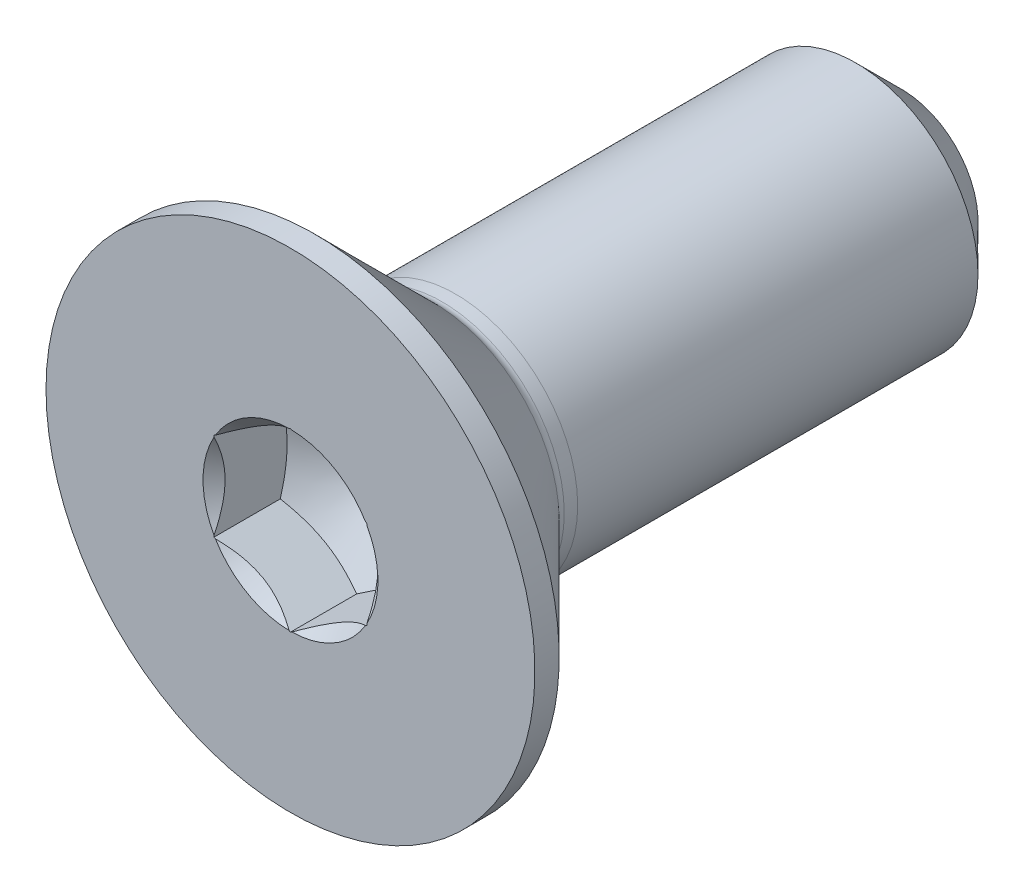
ISO-10303-21;
HEADER;
FILE_DESCRIPTION(('STEP AP214'),'2;1');
FILE_NAME('part.step','',(''),(''),'','','');
FILE_SCHEMA(('AUTOMOTIVE_DESIGN { 1 0 10303 214 1 1 1 1 }'));
ENDSEC;
DATA;
#1=APPLICATION_CONTEXT('core data for automotive mechanical design processes');
#2=APPLICATION_PROTOCOL_DEFINITION('international standard','automotive_design',2000,#1);
#3=PRODUCT_CONTEXT('',#1,'mechanical');
#4=PRODUCT('Part','Part','',(#3));
#5=PRODUCT_RELATED_PRODUCT_CATEGORY('part','',(#4));
#6=PRODUCT_DEFINITION_FORMATION('','',#4);
#7=PRODUCT_DEFINITION_CONTEXT('part definition',#1,'design');
#8=PRODUCT_DEFINITION('design','',#6,#7);
#9=PRODUCT_DEFINITION_SHAPE('','',#8);
#10=(LENGTH_UNIT() NAMED_UNIT(*) SI_UNIT(.MILLI.,.METRE.));
#11=(NAMED_UNIT(*) PLANE_ANGLE_UNIT() SI_UNIT($,.RADIAN.));
#12=(NAMED_UNIT(*) SI_UNIT($,.STERADIAN.) SOLID_ANGLE_UNIT());
#13=UNCERTAINTY_MEASURE_WITH_UNIT(LENGTH_MEASURE(1.E-05),#10,'distance_accuracy_value','');
#14=(GEOMETRIC_REPRESENTATION_CONTEXT(3) GLOBAL_UNCERTAINTY_ASSIGNED_CONTEXT((#13)) GLOBAL_UNIT_ASSIGNED_CONTEXT((#10,
#11,#12)) REPRESENTATION_CONTEXT('',''));
#15=CARTESIAN_POINT('',(0.,0.,0.));
#16=DIRECTION('',(0.,0.,1.));
#17=DIRECTION('',(1.,0.,0.));
#18=AXIS2_PLACEMENT_3D('',#15,#16,#17);
#19=CARTESIAN_POINT('',(0.,0.,0.));
#20=DIRECTION('',(0.,0.,-1.));
#21=DIRECTION('',(-1.,0.,0.));
#22=AXIS2_PLACEMENT_3D('',#19,#20,#21);
#23=CYLINDRICAL_SURFACE('',#22,4.);
#24=CARTESIAN_POINT('',(0.,0.,-18.5));
#25=DIRECTION('',(0.,0.,-1.));
#26=DIRECTION('',(-1.,0.,0.));
#27=AXIS2_PLACEMENT_3D('',#24,#25,#26);
#28=CIRCLE('',#27,4.);
#29=CARTESIAN_POINT('',(-4.,0.,-18.5));
#30=VERTEX_POINT('',#29);
#31=EDGE_CURVE('E52',#30,#30,#28,.T.);
#32=ORIENTED_EDGE('',*,*,#31,.F.);
#33=EDGE_LOOP('',(#32));
#34=FACE_BOUND('',#33,.T.);
#35=CARTESIAN_POINT('',(0.,0.,-5.4));
#36=DIRECTION('',(0.,0.,-1.));
#37=DIRECTION('',(-1.,0.,0.));
#38=AXIS2_PLACEMENT_3D('',#35,#36,#37);
#39=CIRCLE('',#38,4.);
#40=CARTESIAN_POINT('',(-4.,0.,-5.4));
#41=VERTEX_POINT('',#40);
#42=EDGE_CURVE('E11',#41,#41,#39,.T.);
#43=ORIENTED_EDGE('',*,*,#42,.T.);
#44=EDGE_LOOP('',(#43));
#45=FACE_BOUND('',#44,.T.);
#46=ADVANCED_FACE('F46',(#34,#45),#23,.T.);
#47=CARTESIAN_POINT('',(0.,0.,-5.4));
#48=DIRECTION('',(0.,0.,1.));
#49=DIRECTION('',(1.,0.,0.));
#50=AXIS2_PLACEMENT_3D('',#47,#48,#49);
#51=PLANE('',#50);
#52=ORIENTED_EDGE('',*,*,#42,.F.);
#53=EDGE_LOOP('',(#52));
#54=FACE_BOUND('',#53,.T.);
#55=ADVANCED_FACE('F67',(#54),#51,.T.);
#56=CARTESIAN_POINT('',(0.,0.,-18.5));
#57=DIRECTION('',(0.,0.,1.));
#58=DIRECTION('',(1.,0.,0.));
#59=AXIS2_PLACEMENT_3D('',#56,#57,#58);
#60=CONICAL_SURFACE('',#59,4.,0.785398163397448);
#61=CARTESIAN_POINT('',(0.,0.,-20.));
#62=DIRECTION('',(0.,0.,-1.));
#63=DIRECTION('',(-1.,0.,0.));
#64=AXIS2_PLACEMENT_3D('',#61,#62,#63);
#65=CIRCLE('',#64,2.5);
#66=CARTESIAN_POINT('',(-2.5,0.,-20.));
#67=VERTEX_POINT('',#66);
#68=EDGE_CURVE('E56',#67,#67,#65,.T.);
#69=ORIENTED_EDGE('',*,*,#68,.F.);
#70=EDGE_LOOP('',(#69));
#71=FACE_BOUND('',#70,.T.);
#72=ORIENTED_EDGE('',*,*,#31,.T.);
#73=EDGE_LOOP('',(#72));
#74=FACE_BOUND('',#73,.T.);
#75=ADVANCED_FACE('F65',(#71,#74),#60,.T.);
#76=CARTESIAN_POINT('',(0.,0.,-20.));
#77=DIRECTION('',(0.,0.,1.));
#78=DIRECTION('',(1.,0.,0.));
#79=AXIS2_PLACEMENT_3D('',#76,#77,#78);
#80=PLANE('',#79);
#81=ORIENTED_EDGE('',*,*,#68,.T.);
#82=EDGE_LOOP('',(#81));
#83=FACE_BOUND('',#82,.T.);
#84=ADVANCED_FACE('F63',(#83),#80,.F.);
#85=CLOSED_SHELL('',(#46,#55,#75,#84));
#86=MANIFOLD_SOLID_BREP('B2',#85);
#87=CARTESIAN_POINT('',(0.,0.,-4.96));
#88=DIRECTION('',(0.,0.,-1.));
#89=DIRECTION('',(-1.,0.,0.));
#90=AXIS2_PLACEMENT_3D('',#87,#88,#89);
#91=TOROIDAL_SURFACE('',#90,4.4,0.4);
#92=CARTESIAN_POINT('',(0.,0.,-4.96));
#93=DIRECTION('',(0.,0.,-1.));
#94=DIRECTION('',(-1.,0.,0.));
#95=AXIS2_PLACEMENT_3D('',#92,#93,#94);
#96=CIRCLE('',#95,4.);
#97=CARTESIAN_POINT('',(-4.,0.,-4.96));
#98=VERTEX_POINT('',#97);
#99=EDGE_CURVE('E231',#98,#98,#96,.T.);
#100=ORIENTED_EDGE('',*,*,#99,.F.);
#101=EDGE_LOOP('',(#100));
#102=FACE_BOUND('',#101,.T.);
#103=CARTESIAN_POINT('',(0.,0.,-4.67715728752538));
#104=DIRECTION('',(0.,0.,-1.));
#105=DIRECTION('',(-1.,0.,0.));
#106=AXIS2_PLACEMENT_3D('',#103,#104,#105);
#107=CIRCLE('',#106,4.11715728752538);
#108=CARTESIAN_POINT('',(-4.11715728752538,0.,-4.67715728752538));
#109=VERTEX_POINT('',#108);
#110=EDGE_CURVE('E252',#109,#109,#107,.T.);
#111=ORIENTED_EDGE('',*,*,#110,.T.);
#112=EDGE_LOOP('',(#111));
#113=FACE_BOUND('',#112,.T.);
#114=ADVANCED_FACE('F103',(#102,#113),#91,.F.);
#115=CARTESIAN_POINT('',(0.,0.,-0.794314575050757));
#116=DIRECTION('',(0.,0.,1.));
#117=DIRECTION('',(1.,0.,0.));
#118=AXIS2_PLACEMENT_3D('',#115,#116,#117);
#119=CONICAL_SURFACE('',#118,8.,0.785398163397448);
#120=ORIENTED_EDGE('',*,*,#110,.F.);
#121=EDGE_LOOP('',(#120));
#122=FACE_BOUND('',#121,.T.);
#123=CARTESIAN_POINT('',(0.,0.,-0.794314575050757));
#124=DIRECTION('',(0.,0.,-1.));
#125=DIRECTION('',(-1.,0.,0.));
#126=AXIS2_PLACEMENT_3D('',#123,#124,#125);
#127=CIRCLE('',#126,8.);
#128=CARTESIAN_POINT('',(-8.,0.,-0.794314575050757));
#129=VERTEX_POINT('',#128);
#130=EDGE_CURVE('E249',#129,#129,#127,.T.);
#131=ORIENTED_EDGE('',*,*,#130,.T.);
#132=EDGE_LOOP('',(#131));
#133=FACE_BOUND('',#132,.T.);
#134=ADVANCED_FACE('F416',(#122,#133),#119,.T.);
#135=CARTESIAN_POINT('',(0.,0.,0.));
#136=DIRECTION('',(0.,0.,-1.));
#137=DIRECTION('',(-1.,0.,0.));
#138=AXIS2_PLACEMENT_3D('',#135,#136,#137);
#139=CYLINDRICAL_SURFACE('',#138,8.);
#140=ORIENTED_EDGE('',*,*,#130,.F.);
#141=EDGE_LOOP('',(#140));
#142=FACE_BOUND('',#141,.T.);
#143=CARTESIAN_POINT('',(0.,0.,0.));
#144=DIRECTION('',(0.,0.,-1.));
#145=DIRECTION('',(-1.,0.,0.));
#146=AXIS2_PLACEMENT_3D('',#143,#144,#145);
#147=CIRCLE('',#146,8.);
#148=CARTESIAN_POINT('',(-8.,0.,0.));
#149=VERTEX_POINT('',#148);
#150=EDGE_CURVE('E246',#149,#149,#147,.T.);
#151=ORIENTED_EDGE('',*,*,#150,.T.);
#152=EDGE_LOOP('',(#151));
#153=FACE_BOUND('',#152,.T.);
#154=ADVANCED_FACE('F421',(#142,#153),#139,.T.);
#155=CARTESIAN_POINT('',(0.,0.,0.));
#156=DIRECTION('',(0.,0.,-1.));
#157=DIRECTION('',(-1.,0.,0.));
#158=AXIS2_PLACEMENT_3D('',#155,#156,#157);
#159=PLANE('',#158);
#160=ORIENTED_EDGE('',*,*,#150,.F.);
#161=EDGE_LOOP('',(#160));
#162=FACE_BOUND('',#161,.T.);
#163=DIRECTION('',(-0.866025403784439,-0.5,0.));
#164=VECTOR('',#163,1.);
#165=CARTESIAN_POINT('',(0.,2.88675134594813,0.));
#166=LINE('',#165,#164);
#167=CARTESIAN_POINT('',(-2.45566856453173,1.46897043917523,0.));
#168=VERTEX_POINT('',#167);
#169=CARTESIAN_POINT('',(-2.5,1.44337567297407,0.));
#170=VERTEX_POINT('',#169);
#171=EDGE_CURVE('E386',#168,#170,#166,.T.);
#172=ORIENTED_EDGE('',*,*,#171,.F.);
#173=CARTESIAN_POINT('',(0.,0.,0.));
#174=DIRECTION('',(0.,0.,-1.));
#175=DIRECTION('',(-1.,0.,0.));
#176=AXIS2_PLACEMENT_3D('',#173,#174,#175);
#177=CIRCLE('',#176,2.8615);
#178=CARTESIAN_POINT('',(-0.0443314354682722,2.86115657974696,0.));
#179=VERTEX_POINT('',#178);
#180=EDGE_CURVE('E213',#168,#179,#177,.T.);
#181=ORIENTED_EDGE('',*,*,#180,.T.);
#182=CARTESIAN_POINT('',(0.,2.88675134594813,0.));
#183=VERTEX_POINT('',#182);
#184=EDGE_CURVE('E224',#183,#179,#166,.T.);
#185=ORIENTED_EDGE('',*,*,#184,.F.);
#186=DIRECTION('',(-0.866025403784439,0.5,0.));
#187=VECTOR('',#186,1.);
#188=CARTESIAN_POINT('',(2.5,1.44337567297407,0.));
#189=LINE('',#188,#187);
#190=CARTESIAN_POINT('',(0.044331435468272,2.86115657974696,0.));
#191=VERTEX_POINT('',#190);
#192=EDGE_CURVE('E389',#191,#183,#189,.T.);
#193=ORIENTED_EDGE('',*,*,#192,.F.);
#194=CARTESIAN_POINT('',(2.45566856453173,1.46897043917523,0.));
#195=VERTEX_POINT('',#194);
#196=EDGE_CURVE('E400',#191,#195,#177,.T.);
#197=ORIENTED_EDGE('',*,*,#196,.T.);
#198=CARTESIAN_POINT('',(2.5,1.44337567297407,0.));
#199=VERTEX_POINT('',#198);
#200=EDGE_CURVE('E388',#199,#195,#189,.T.);
#201=ORIENTED_EDGE('',*,*,#200,.F.);
#202=DIRECTION('',(0.,1.,0.));
#203=VECTOR('',#202,1.);
#204=CARTESIAN_POINT('',(2.5,-1.44337567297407,0.));
#205=LINE('',#204,#203);
#206=CARTESIAN_POINT('',(2.5,1.39218614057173,0.));
#207=VERTEX_POINT('',#206);
#208=EDGE_CURVE('E392',#207,#199,#205,.T.);
#209=ORIENTED_EDGE('',*,*,#208,.F.);
#210=CARTESIAN_POINT('',(2.5,-1.39218614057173,0.));
#211=VERTEX_POINT('',#210);
#212=EDGE_CURVE('E398',#207,#211,#177,.T.);
#213=ORIENTED_EDGE('',*,*,#212,.T.);
#214=CARTESIAN_POINT('',(2.5,-1.44337567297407,0.));
#215=VERTEX_POINT('',#214);
#216=EDGE_CURVE('E377',#215,#211,#205,.T.);
#217=ORIENTED_EDGE('',*,*,#216,.F.);
#218=DIRECTION('',(0.866025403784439,0.5,0.));
#219=VECTOR('',#218,1.);
#220=CARTESIAN_POINT('',(0.,-2.88675134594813,0.));
#221=LINE('',#220,#219);
#222=CARTESIAN_POINT('',(2.45566856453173,-1.46897043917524,0.));
#223=VERTEX_POINT('',#222);
#224=EDGE_CURVE('E372',#223,#215,#221,.T.);
#225=ORIENTED_EDGE('',*,*,#224,.F.);
#226=CARTESIAN_POINT('',(0.0443314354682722,-2.86115657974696,0.));
#227=VERTEX_POINT('',#226);
#228=EDGE_CURVE('E396',#223,#227,#177,.T.);
#229=ORIENTED_EDGE('',*,*,#228,.T.);
#230=CARTESIAN_POINT('',(0.,-2.88675134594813,0.));
#231=VERTEX_POINT('',#230);
#232=EDGE_CURVE('E393',#231,#227,#221,.T.);
#233=ORIENTED_EDGE('',*,*,#232,.F.);
#234=DIRECTION('',(0.866025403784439,-0.5,0.));
#235=VECTOR('',#234,1.);
#236=CARTESIAN_POINT('',(-2.5,-1.44337567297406,0.));
#237=LINE('',#236,#235);
#238=CARTESIAN_POINT('',(-0.0443314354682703,-2.86115657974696,0.));
#239=VERTEX_POINT('',#238);
#240=EDGE_CURVE('E301',#239,#231,#237,.T.);
#241=ORIENTED_EDGE('',*,*,#240,.F.);
#242=CARTESIAN_POINT('',(-2.45566856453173,-1.46897043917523,0.));
#243=VERTEX_POINT('',#242);
#244=EDGE_CURVE('E122',#239,#243,#177,.T.);
#245=ORIENTED_EDGE('',*,*,#244,.T.);
#246=CARTESIAN_POINT('',(-2.5,-1.44337567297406,0.));
#247=VERTEX_POINT('',#246);
#248=EDGE_CURVE('E308',#247,#243,#237,.T.);
#249=ORIENTED_EDGE('',*,*,#248,.F.);
#250=DIRECTION('',(0.,-1.,0.));
#251=VECTOR('',#250,1.);
#252=CARTESIAN_POINT('',(-2.5,1.44337567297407,0.));
#253=LINE('',#252,#251);
#254=CARTESIAN_POINT('',(-2.5,-1.39218614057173,0.));
#255=VERTEX_POINT('',#254);
#256=EDGE_CURVE('E211',#255,#247,#253,.T.);
#257=ORIENTED_EDGE('',*,*,#256,.F.);
#258=CARTESIAN_POINT('',(-2.5,1.39218614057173,0.));
#259=VERTEX_POINT('',#258);
#260=EDGE_CURVE('E129',#255,#259,#177,.T.);
#261=ORIENTED_EDGE('',*,*,#260,.T.);
#262=EDGE_CURVE('E209',#170,#259,#253,.T.);
#263=ORIENTED_EDGE('',*,*,#262,.F.);
#264=EDGE_LOOP('',(#172,#181,#185,#193,#197,#201,#209,#213,#217,#225,#229,#233,#241,#245,#249,
#257,#261,#263));
#265=FACE_BOUND('',#264,.T.);
#266=ADVANCED_FACE('F208',(#162,#265),#159,.F.);
#267=CARTESIAN_POINT('',(0.,0.,-5.4));
#268=DIRECTION('',(0.,0.,1.));
#269=DIRECTION('',(1.,0.,0.));
#270=AXIS2_PLACEMENT_3D('',#267,#268,#269);
#271=PLANE('',#270);
#272=CARTESIAN_POINT('',(0.,0.,-5.4));
#273=DIRECTION('',(0.,0.,-1.));
#274=DIRECTION('',(-1.,0.,0.));
#275=AXIS2_PLACEMENT_3D('',#272,#273,#274);
#276=CIRCLE('',#275,4.);
#277=CARTESIAN_POINT('',(-4.,0.,-5.4));
#278=VERTEX_POINT('',#277);
#279=EDGE_CURVE('E243',#278,#278,#276,.T.);
#280=ORIENTED_EDGE('',*,*,#279,.T.);
#281=EDGE_LOOP('',(#280));
#282=FACE_BOUND('',#281,.T.);
#283=ADVANCED_FACE('F435',(#282),#271,.F.);
#284=CARTESIAN_POINT('',(0.,0.,0.));
#285=DIRECTION('',(0.,0.,-1.));
#286=DIRECTION('',(-1.,0.,0.));
#287=AXIS2_PLACEMENT_3D('',#284,#285,#286);
#288=CYLINDRICAL_SURFACE('',#287,4.);
#289=ORIENTED_EDGE('',*,*,#279,.F.);
#290=EDGE_LOOP('',(#289));
#291=FACE_BOUND('',#290,.T.);
#292=ORIENTED_EDGE('',*,*,#99,.T.);
#293=EDGE_LOOP('',(#292));
#294=FACE_BOUND('',#293,.T.);
#295=ADVANCED_FACE('F287',(#291,#294),#288,.T.);
#296=CARTESIAN_POINT('',(-2.5,-1.44337567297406,-3.83333333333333));
#297=DIRECTION('',(-0.5,-0.866025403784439,0.));
#298=DIRECTION('',(0.866025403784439,-0.5,0.));
#299=AXIS2_PLACEMENT_3D('',#296,#297,#298);
#300=PLANE('',#299);
#301=ORIENTED_EDGE('',*,*,#248,.T.);
#302=CARTESIAN_POINT('',(-2.45602453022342,-1.46876492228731,0.000200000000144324));
#303=CARTESIAN_POINT('',(-2.37266635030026,-1.5168917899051,-0.0466050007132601));
#304=CARTESIAN_POINT('',(-2.28794081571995,-1.56580810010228,-0.0905436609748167));
#305=CARTESIAN_POINT('',(-2.11532462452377,-1.66546810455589,-0.170781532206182));
#306=CARTESIAN_POINT('',(-2.02741967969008,-1.71622004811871,-0.207039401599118));
#307=CARTESIAN_POINT('',(-1.85019610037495,-1.81854012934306,-0.269015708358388));
#308=CARTESIAN_POINT('',(-1.76091695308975,-1.87008546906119,-0.294880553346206));
#309=CARTESIAN_POINT('',(-1.58051931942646,-1.97423809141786,-0.334592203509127));
#310=CARTESIAN_POINT('',(-1.48940545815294,-2.02684270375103,-0.34846610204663));
#311=CARTESIAN_POINT('',(-1.3302223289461,-2.11874712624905,-0.361004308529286));
#312=CARTESIAN_POINT('',(-1.26232496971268,-2.15794768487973,-0.362686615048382));
#313=CARTESIAN_POINT('',(-1.12666869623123,-2.2362688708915,-0.358670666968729));
#314=CARTESIAN_POINT('',(-1.05890983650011,-2.27538946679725,-0.352969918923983));
#315=CARTESIAN_POINT('',(-0.924061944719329,-2.35324393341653,-0.334513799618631));
#316=CARTESIAN_POINT('',(-0.856973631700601,-2.39197738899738,-0.321751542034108));
#317=CARTESIAN_POINT('',(-0.72396889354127,-2.46876771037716,-0.289866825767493));
#318=CARTESIAN_POINT('',(-0.65805236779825,-2.50682463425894,-0.270744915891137));
#319=CARTESIAN_POINT('',(-0.498170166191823,-2.59913266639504,-0.217124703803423));
#320=CARTESIAN_POINT('',(-0.404969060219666,-2.65294235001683,-0.179581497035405));
#321=CARTESIAN_POINT('',(-0.267695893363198,-2.73219704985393,-0.116647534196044));
#322=CARTESIAN_POINT('',(-0.222424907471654,-2.75833426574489,-0.0946039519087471));
#323=CARTESIAN_POINT('',(-0.132645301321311,-2.81016854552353,-0.0485843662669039));
#324=CARTESIAN_POINT('',(-0.0881363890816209,-2.83586577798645,-0.024609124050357));
#325=CARTESIAN_POINT('',(-0.0439754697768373,-2.86136209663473,0.000200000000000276));
#326=B_SPLINE_CURVE_WITH_KNOTS('',3,(#302,#303,#304,#305,#306,#307,#308,#309,#310,#311,#312,
#313,#314,#315,#316,#317,#318,#319,#320,#321,#322,#323,#324,#325),.UNSPECIFIED.,.F.,.F.,(4,2,2,
2,2,2,2,2,2,2,2,4),(0.,0.321296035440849,0.644279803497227,0.962539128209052,1.28007745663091,
1.51500097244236,1.75000384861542,1.98523630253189,2.22044846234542,2.56179557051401,
2.73196477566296,2.90206725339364),.UNSPECIFIED.);
#327=EDGE_CURVE('E202',#243,#239,#326,.T.);
#328=ORIENTED_EDGE('',*,*,#327,.T.);
#329=ORIENTED_EDGE('',*,*,#240,.T.);
#330=DIRECTION('',(0.,0.,1.));
#331=VECTOR('',#330,1.);
#332=CARTESIAN_POINT('',(0.,-2.88675134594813,-3.83333333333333));
#333=LINE('',#332,#331);
#334=CARTESIAN_POINT('',(0.,-2.88675134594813,-2.16666666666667));
#335=VERTEX_POINT('',#334);
#336=EDGE_CURVE('E219',#335,#231,#333,.T.);
#337=ORIENTED_EDGE('',*,*,#336,.F.);
#338=CARTESIAN_POINT('',(0.000200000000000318,-2.88686681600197,-2.16659999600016));
#339=CARTESIAN_POINT('',(-0.109663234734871,-2.82343724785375,-2.20323604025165));
#340=CARTESIAN_POINT('',(-0.220474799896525,-2.75946016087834,-2.23655544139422));
#341=CARTESIAN_POINT('',(-0.44401683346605,-2.63039810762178,-2.29471537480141));
#342=CARTESIAN_POINT('',(-0.556751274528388,-2.5653108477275,-2.31953533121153));
#343=CARTESIAN_POINT('',(-0.780822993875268,-2.43594298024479,-2.35817200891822));
#344=CARTESIAN_POINT('',(-0.892125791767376,-2.37168227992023,-2.37224586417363));
#345=CARTESIAN_POINT('',(-1.11525522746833,-2.24285844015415,-2.38904850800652));
#346=CARTESIAN_POINT('',(-1.22708105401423,-2.17829576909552,-2.39179120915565));
#347=CARTESIAN_POINT('',(-1.43604197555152,-2.05765212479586,-2.38609190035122));
#348=CARTESIAN_POINT('',(-1.53320831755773,-2.0015531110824,-2.37904926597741));
#349=CARTESIAN_POINT('',(-1.726907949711,-1.88972057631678,-2.35672624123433));
#350=CARTESIAN_POINT('',(-1.82344056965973,-1.8339874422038,-2.34143822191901));
#351=CARTESIAN_POINT('',(-2.01753972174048,-1.7219242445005,-2.30321856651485));
#352=CARTESIAN_POINT('',(-2.11508168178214,-1.66560836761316,-2.28012488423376));
#353=CARTESIAN_POINT('',(-2.30871060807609,-1.55381665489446,-2.22771100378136));
#354=CARTESIAN_POINT('',(-2.40480005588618,-1.49833938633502,-2.19840312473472));
#355=CARTESIAN_POINT('',(-2.5002,-1.44326020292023,-2.16659999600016));
#356=B_SPLINE_CURVE_WITH_KNOTS('',3,(#338,#339,#340,#341,#342,#343,#344,#345,#346,#347,#348,
#349,#350,#351,#352,#353,#354,#355),.UNSPECIFIED.,.F.,.F.,(4,2,2,2,2,2,2,2,4),(0.,
0.396285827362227,0.793524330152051,1.18093086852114,1.56786160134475,1.90479741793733,
2.24204551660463,2.58677531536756,2.93082800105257),.UNSPECIFIED.);
#357=CARTESIAN_POINT('',(-2.5,-1.44337567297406,-2.16666666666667));
#358=VERTEX_POINT('',#357);
#359=EDGE_CURVE('E116',#335,#358,#356,.T.);
#360=ORIENTED_EDGE('',*,*,#359,.T.);
#361=DIRECTION('',(0.,0.,1.));
#362=VECTOR('',#361,1.);
#363=CARTESIAN_POINT('',(-2.5,-1.44337567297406,-3.83333333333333));
#364=LINE('',#363,#362);
#365=EDGE_CURVE('E228',#358,#247,#364,.T.);
#366=ORIENTED_EDGE('',*,*,#365,.T.);
#367=EDGE_LOOP('',(#301,#328,#329,#337,#360,#366));
#368=FACE_BOUND('',#367,.T.);
#369=ADVANCED_FACE('F282',(#368),#300,.F.);
#370=CARTESIAN_POINT('',(-2.5,1.44337567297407,-3.83333333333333));
#371=DIRECTION('',(-1.,0.,0.));
#372=DIRECTION('',(0.,0.,1.));
#373=AXIS2_PLACEMENT_3D('',#370,#371,#372);
#374=PLANE('',#373);
#375=ORIENTED_EDGE('',*,*,#262,.T.);
#376=CARTESIAN_POINT('',(-2.5,-2.90777520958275,0.973230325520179));
#377=CARTESIAN_POINT('',(-2.5,-2.83710370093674,0.91965413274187));
#378=CARTESIAN_POINT('',(-2.5,-2.76603977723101,0.866587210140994));
#379=CARTESIAN_POINT('',(-2.5,-2.62297105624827,0.76170095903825));
#380=CARTESIAN_POINT('',(-2.5,-2.55096603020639,0.709881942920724));
#381=CARTESIAN_POINT('',(-2.5,-2.40533228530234,0.607351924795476));
#382=CARTESIAN_POINT('',(-2.5,-2.3316953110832,0.556652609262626));
#383=CARTESIAN_POINT('',(-2.5,-2.18317658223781,0.457117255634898));
#384=CARTESIAN_POINT('',(-2.5,-2.1082949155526,0.408281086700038));
#385=CARTESIAN_POINT('',(-2.5,-1.95265079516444,0.310090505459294));
#386=CARTESIAN_POINT('',(-2.5,-1.87180105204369,0.260873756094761));
#387=CARTESIAN_POINT('',(-2.5,-1.708234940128,0.165651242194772));
#388=CARTESIAN_POINT('',(-2.5,-1.62551881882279,0.119645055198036));
#389=CARTESIAN_POINT('',(-2.5,-1.45818603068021,0.0318111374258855));
#390=CARTESIAN_POINT('',(-2.5,-1.37357556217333,-0.0100283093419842));
#391=CARTESIAN_POINT('',(-2.5,-1.20202799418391,-0.0885842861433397));
#392=CARTESIAN_POINT('',(-2.5,-1.11509197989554,-0.125303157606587));
#393=CARTESIAN_POINT('',(-2.5,-0.946211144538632,-0.189469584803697));
#394=CARTESIAN_POINT('',(-2.5,-0.864466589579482,-0.217438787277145));
#395=CARTESIAN_POINT('',(-2.5,-0.698983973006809,-0.266823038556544));
#396=CARTESIAN_POINT('',(-2.5,-0.615245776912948,-0.28823764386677));
#397=CARTESIAN_POINT('',(-2.5,-0.44768276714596,-0.323029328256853));
#398=CARTESIAN_POINT('',(-2.5,-0.363887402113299,-0.336545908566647));
#399=CARTESIAN_POINT('',(-2.5,-0.19536880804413,-0.355274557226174));
#400=CARTESIAN_POINT('',(-2.5,-0.110645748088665,-0.360488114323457));
#401=CARTESIAN_POINT('',(-2.5,0.0556873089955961,-0.36221085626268));
#402=CARTESIAN_POINT('',(-2.5,0.137294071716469,-0.35904124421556));
#403=CARTESIAN_POINT('',(-2.5,0.299822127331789,-0.344888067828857));
#404=CARTESIAN_POINT('',(-2.5,0.380743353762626,-0.333903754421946));
#405=CARTESIAN_POINT('',(-2.5,0.542686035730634,-0.304539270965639));
#406=CARTESIAN_POINT('',(-2.5,0.623684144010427,-0.286032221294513));
#407=CARTESIAN_POINT('',(-2.5,0.783903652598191,-0.242614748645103));
#408=CARTESIAN_POINT('',(-2.5,0.863125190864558,-0.217704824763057));
#409=CARTESIAN_POINT('',(-2.5,1.11125083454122,-0.130284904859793));
#410=CARTESIAN_POINT('',(-2.5,1.27667909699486,-0.0578729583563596));
#411=CARTESIAN_POINT('',(-2.5,1.51876527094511,0.0628396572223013));
#412=CARTESIAN_POINT('',(-2.5,1.59860172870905,0.105187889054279));
#413=CARTESIAN_POINT('',(-2.5,1.75646209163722,0.193145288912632));
#414=CARTESIAN_POINT('',(-2.5,1.83448631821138,0.238753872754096));
#415=CARTESIAN_POINT('',(-2.5,1.98510126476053,0.330244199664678));
#416=CARTESIAN_POINT('',(-2.5,2.05776940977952,0.375999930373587));
#417=CARTESIAN_POINT('',(-2.5,2.2018595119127,0.469442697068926));
#418=CARTESIAN_POINT('',(-2.5,2.27328137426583,0.517129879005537));
#419=CARTESIAN_POINT('',(-2.5,2.41446216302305,0.613696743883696));
#420=CARTESIAN_POINT('',(-2.5,2.4842298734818,0.662563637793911));
#421=CARTESIAN_POINT('',(-2.5,2.62281088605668,0.76159421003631));
#422=CARTESIAN_POINT('',(-2.5,2.69162444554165,0.81175752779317));
#423=CARTESIAN_POINT('',(-2.5,2.76003848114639,0.86245118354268));
#424=B_SPLINE_CURVE_WITH_KNOTS('',3,(#376,#377,#378,#379,#380,#381,#382,#383,#384,#385,#386,
#387,#388,#389,#390,#391,#392,#393,#394,#395,#396,#397,#398,#399,#400,#401,#402,#403,#404,#405,
#406,#407,#408,#409,#410,#411,#412,#413,#414,#415,#416,#417,#418,#419,#420,#421,#422,#423),
.UNSPECIFIED.,.F.,.F.,(4,2,2,2,2,2,2,2,2,2,2,2,2,2,2,2,2,2,2,2,2,2,2,4),(0.,0.26605749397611,
0.532180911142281,0.800364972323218,1.06853016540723,1.35242685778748,1.63628612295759,
1.91932325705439,2.20223054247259,2.46119496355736,2.72017690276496,2.97443424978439,
3.2286460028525,3.47325995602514,3.71789735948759,3.96684439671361,4.21577203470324,
4.75583593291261,5.0269322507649,5.29798011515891,5.55556936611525,5.81317811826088,
6.06870010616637,6.32415177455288),.UNSPECIFIED.);
#425=EDGE_CURVE('E197',#259,#255,#424,.F.);
#426=ORIENTED_EDGE('',*,*,#425,.T.);
#427=ORIENTED_EDGE('',*,*,#256,.T.);
#428=ORIENTED_EDGE('',*,*,#365,.F.);
#429=CARTESIAN_POINT('',(-2.5,-3.73786280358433,-1.23707844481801));
#430=CARTESIAN_POINT('',(-2.5,-3.62990419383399,-1.28887290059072));
#431=CARTESIAN_POINT('',(-2.5,-3.52168258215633,-1.34012937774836));
#432=CARTESIAN_POINT('',(-2.5,-3.30457318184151,-1.44126118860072));
#433=CARTESIAN_POINT('',(-2.5,-3.19568527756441,-1.49113627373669));
#434=CARTESIAN_POINT('',(-2.5,-2.9764787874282,-1.58947874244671));
#435=CARTESIAN_POINT('',(-2.5,-2.86615552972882,-1.63793575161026));
#436=CARTESIAN_POINT('',(-2.5,-2.64458325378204,-1.73267683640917));
#437=CARTESIAN_POINT('',(-2.5,-2.53333428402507,-1.7789610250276));
#438=CARTESIAN_POINT('',(-2.5,-2.30680312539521,-1.86995645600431));
#439=CARTESIAN_POINT('',(-2.5,-2.19149153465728,-1.91459493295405));
#440=CARTESIAN_POINT('',(-2.5,-1.95947357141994,-2.00016060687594));
#441=CARTESIAN_POINT('',(-2.5,-1.84276703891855,-2.04108737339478));
#442=CARTESIAN_POINT('',(-2.5,-1.60804308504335,-2.11805925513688));
#443=CARTESIAN_POINT('',(-2.5,-1.49002940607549,-2.15411565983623));
#444=CARTESIAN_POINT('',(-2.5,-1.25231072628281,-2.22011374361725));
#445=CARTESIAN_POINT('',(-2.5,-1.13260615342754,-2.25005694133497));
#446=CARTESIAN_POINT('',(-2.5,-0.891755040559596,-2.30223241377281));
#447=CARTESIAN_POINT('',(-2.5,-0.770611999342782,-2.32448052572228));
#448=CARTESIAN_POINT('',(-2.5,-0.52697058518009,-2.35980898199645));
#449=CARTESIAN_POINT('',(-2.5,-0.404472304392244,-2.37288994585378));
#450=CARTESIAN_POINT('',(-2.5,-0.16026639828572,-2.38867044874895));
#451=CARTESIAN_POINT('',(-2.5,-0.0385668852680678,-2.39149249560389));
#452=CARTESIAN_POINT('',(-2.5,0.204641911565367,-2.3868308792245));
#453=CARTESIAN_POINT('',(-2.5,0.326151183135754,-2.37934657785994));
#454=CARTESIAN_POINT('',(-2.5,0.536550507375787,-2.35796804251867));
#455=CARTESIAN_POINT('',(-2.5,0.625673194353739,-2.34625786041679));
#456=CARTESIAN_POINT('',(-2.5,0.803173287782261,-2.31809845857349));
#457=CARTESIAN_POINT('',(-2.5,0.891550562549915,-2.30164841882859));
#458=CARTESIAN_POINT('',(-2.5,1.15551872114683,-2.24605852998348));
#459=CARTESIAN_POINT('',(-2.5,1.32980845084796,-2.20069460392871));
#460=CARTESIAN_POINT('',(-2.5,1.59042392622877,-2.12319255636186));
#461=CARTESIAN_POINT('',(-2.5,1.67812347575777,-2.09542098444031));
#462=CARTESIAN_POINT('',(-2.5,1.85261472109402,-2.03730962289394));
#463=CARTESIAN_POINT('',(-2.5,1.93940694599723,-2.0069714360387));
#464=CARTESIAN_POINT('',(-2.5,2.11219305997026,-1.94416643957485));
#465=CARTESIAN_POINT('',(-2.5,2.19818709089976,-1.91170001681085));
#466=CARTESIAN_POINT('',(-2.5,2.36949800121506,-1.8449902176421));
#467=CARTESIAN_POINT('',(-2.5,2.45481476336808,-1.81074654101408));
#468=CARTESIAN_POINT('',(-2.5,2.67258848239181,-1.72114374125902));
#469=CARTESIAN_POINT('',(-2.5,2.80460967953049,-1.66472689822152));
#470=CARTESIAN_POINT('',(-2.5,3.06746265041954,-1.54917907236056));
#471=CARTESIAN_POINT('',(-2.5,3.19829433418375,-1.49004788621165));
#472=CARTESIAN_POINT('',(-2.5,3.45901422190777,-1.36968777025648));
#473=CARTESIAN_POINT('',(-2.5,3.58890225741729,-1.30845847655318));
#474=CARTESIAN_POINT('',(-2.5,3.8478960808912,-1.18436469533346));
#475=CARTESIAN_POINT('',(-2.5,3.9770018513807,-1.12150017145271));
#476=CARTESIAN_POINT('',(-2.5,4.36367805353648,-0.930830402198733));
#477=CARTESIAN_POINT('',(-2.5,4.62029579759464,-0.801094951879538));
#478=CARTESIAN_POINT('',(-2.5,5.13177424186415,-0.5383061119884));
#479=CARTESIAN_POINT('',(-2.5,5.38663516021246,-0.405253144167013));
#480=CARTESIAN_POINT('',(-2.5,5.8711418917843,-0.149511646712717));
#481=CARTESIAN_POINT('',(-2.5,6.10089718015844,-0.0270301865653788));
#482=CARTESIAN_POINT('',(-2.5,6.55966877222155,0.219327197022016));
#483=CARTESIAN_POINT('',(-2.5,6.78868504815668,0.343203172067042));
#484=CARTESIAN_POINT('',(-2.5,7.24556639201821,0.591684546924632));
#485=CARTESIAN_POINT('',(-2.5,7.47343290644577,0.716287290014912));
#486=CARTESIAN_POINT('',(-2.5,7.92870524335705,0.966303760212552));
#487=CARTESIAN_POINT('',(-2.5,8.15611108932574,1.09171744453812));
#488=CARTESIAN_POINT('',(-2.5,8.38335143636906,1.2174283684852));
#489=B_SPLINE_CURVE_WITH_KNOTS('',3,(#429,#430,#431,#432,#433,#434,#435,#436,#437,#438,#439,
#440,#441,#442,#443,#444,#445,#446,#447,#448,#449,#450,#451,#452,#453,#454,#455,#456,#457,#458,
#459,#460,#461,#462,#463,#464,#465,#466,#467,#468,#469,#470,#471,#472,#473,#474,#475,#476,#477,
#478,#479,#480,#481,#482,#483,#484,#485,#486,#487,#488),.UNSPECIFIED.,.F.,.F.,(4,2,2,2,2,2,2,2,
2,2,2,2,2,2,2,2,2,2,2,2,2,2,2,2,2,2,2,2,2,4),(0.,0.359225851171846,0.718515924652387,
1.07998546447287,1.44143618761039,1.81233728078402,2.18328133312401,2.553350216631,
2.92332705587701,3.29253785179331,3.66172369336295,4.02648611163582,4.39127111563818,
4.66080405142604,4.93038364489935,5.46995614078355,5.74591174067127,6.02169626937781,
6.29743080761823,6.57321207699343,7.00387918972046,7.43457861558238,7.86535312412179,
8.29613722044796,9.15873745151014,10.0212285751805,10.8023128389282,11.5834261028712,
12.3625525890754,13.1416383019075),.UNSPECIFIED.);
#490=CARTESIAN_POINT('',(-2.5,1.44337567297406,-2.16666666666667));
#491=VERTEX_POINT('',#490);
#492=EDGE_CURVE('E352',#358,#491,#489,.T.);
#493=ORIENTED_EDGE('',*,*,#492,.T.);
#494=DIRECTION('',(0.,0.,1.));
#495=VECTOR('',#494,1.);
#496=CARTESIAN_POINT('',(-2.5,1.44337567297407,-3.83333333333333));
#497=LINE('',#496,#495);
#498=EDGE_CURVE('E218',#491,#170,#497,.T.);
#499=ORIENTED_EDGE('',*,*,#498,.T.);
#500=EDGE_LOOP('',(#375,#426,#427,#428,#493,#499));
#501=FACE_BOUND('',#500,.T.);
#502=ADVANCED_FACE('F215',(#501),#374,.F.);
#503=CARTESIAN_POINT('',(0.,2.88675134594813,-3.83333333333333));
#504=DIRECTION('',(-0.5,0.866025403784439,0.));
#505=DIRECTION('',(-0.866025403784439,-0.5,0.));
#506=AXIS2_PLACEMENT_3D('',#503,#504,#505);
#507=PLANE('',#506);
#508=ORIENTED_EDGE('',*,*,#184,.T.);
#509=CARTESIAN_POINT('',(-0.0439754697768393,2.86136209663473,0.000199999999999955));
#510=CARTESIAN_POINT('',(-0.12733364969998,2.81323522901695,-0.0466050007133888));
#511=CARTESIAN_POINT('',(-0.212059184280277,2.76431891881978,-0.0905436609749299));
#512=CARTESIAN_POINT('',(-0.384675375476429,2.66465891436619,-0.170781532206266));
#513=CARTESIAN_POINT('',(-0.4725803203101,2.61390697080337,-0.207039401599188));
#514=CARTESIAN_POINT('',(-0.649803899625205,2.51158688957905,-0.269015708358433));
#515=CARTESIAN_POINT('',(-0.739083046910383,2.46004154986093,-0.294880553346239));
#516=CARTESIAN_POINT('',(-0.919480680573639,2.35588892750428,-0.334592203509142));
#517=CARTESIAN_POINT('',(-1.01059454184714,2.30328431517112,-0.348466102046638));
#518=CARTESIAN_POINT('',(-1.16977767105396,2.21137989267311,-0.361004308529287));
#519=CARTESIAN_POINT('',(-1.23767503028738,2.17217933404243,-0.362686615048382));
#520=CARTESIAN_POINT('',(-1.37333130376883,2.09385814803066,-0.358670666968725));
#521=CARTESIAN_POINT('',(-1.44109016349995,2.05473755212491,-0.352969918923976));
#522=CARTESIAN_POINT('',(-1.57593805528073,1.97688308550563,-0.33451379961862));
#523=CARTESIAN_POINT('',(-1.64302636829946,1.93814962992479,-0.321751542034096));
#524=CARTESIAN_POINT('',(-1.77603110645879,1.861359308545,-0.289866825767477));
#525=CARTESIAN_POINT('',(-1.84194763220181,1.82330238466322,-0.270744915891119));
#526=CARTESIAN_POINT('',(-2.00182983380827,1.7309943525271,-0.217124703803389));
#527=CARTESIAN_POINT('',(-2.09503093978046,1.67718466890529,-0.179581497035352));
#528=CARTESIAN_POINT('',(-2.23230410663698,1.59792996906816,-0.11664753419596));
#529=CARTESIAN_POINT('',(-2.27757509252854,1.57179275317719,-0.0946039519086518));
#530=CARTESIAN_POINT('',(-2.36735469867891,1.51995847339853,-0.0485843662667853));
#531=CARTESIAN_POINT('',(-2.41186361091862,1.4942612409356,-0.024609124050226));
#532=CARTESIAN_POINT('',(-2.45602453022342,1.46876492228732,0.000200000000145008));
#533=B_SPLINE_CURVE_WITH_KNOTS('',3,(#509,#510,#511,#512,#513,#514,#515,#516,#517,#518,#519,
#520,#521,#522,#523,#524,#525,#526,#527,#528,#529,#530,#531,#532),.UNSPECIFIED.,.F.,.F.,(4,2,2,
2,2,2,2,2,2,2,2,4),(0.,0.321296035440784,0.644279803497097,0.962539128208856,1.28007745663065,
1.5150009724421,1.75000384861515,1.98523630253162,2.22044846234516,2.56179557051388,
2.73196477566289,2.90206725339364),.UNSPECIFIED.);
#534=EDGE_CURVE('E203',#179,#168,#533,.T.);
#535=ORIENTED_EDGE('',*,*,#534,.T.);
#536=ORIENTED_EDGE('',*,*,#171,.T.);
#537=ORIENTED_EDGE('',*,*,#498,.F.);
#538=CARTESIAN_POINT('',(-2.5002,1.44326020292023,-2.16659999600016));
#539=CARTESIAN_POINT('',(-2.39033676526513,1.50668977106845,-2.20323604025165));
#540=CARTESIAN_POINT('',(-2.27952520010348,1.57066685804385,-2.23655544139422));
#541=CARTESIAN_POINT('',(-2.05598316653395,1.69972891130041,-2.29471537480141));
#542=CARTESIAN_POINT('',(-1.94324872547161,1.7648161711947,-2.31953533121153));
#543=CARTESIAN_POINT('',(-1.71917700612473,1.8941840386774,-2.35817200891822));
#544=CARTESIAN_POINT('',(-1.60787420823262,1.95844473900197,-2.37224586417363));
#545=CARTESIAN_POINT('',(-1.38474477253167,2.08726857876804,-2.38904850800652));
#546=CARTESIAN_POINT('',(-1.27291894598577,2.15183124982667,-2.39179120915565));
#547=CARTESIAN_POINT('',(-1.06395802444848,2.27247489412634,-2.38609190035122));
#548=CARTESIAN_POINT('',(-0.966791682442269,2.32857390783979,-2.37904926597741));
#549=CARTESIAN_POINT('',(-0.773092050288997,2.44040644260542,-2.35672624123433));
#550=CARTESIAN_POINT('',(-0.676559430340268,2.4961395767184,-2.341438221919));
#551=CARTESIAN_POINT('',(-0.482460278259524,2.60820277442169,-2.30321856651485));
#552=CARTESIAN_POINT('',(-0.38491831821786,2.66451865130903,-2.28012488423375));
#553=CARTESIAN_POINT('',(-0.191289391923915,2.77631036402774,-2.22771100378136));
#554=CARTESIAN_POINT('',(-0.0951999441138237,2.83178763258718,-2.19840312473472));
#555=CARTESIAN_POINT('',(0.000200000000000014,2.88686681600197,-2.16659999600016));
#556=B_SPLINE_CURVE_WITH_KNOTS('',3,(#538,#539,#540,#541,#542,#543,#544,#545,#546,#547,#548,
#549,#550,#551,#552,#553,#554,#555),.UNSPECIFIED.,.F.,.F.,(4,2,2,2,2,2,2,2,4),(0.,
0.396285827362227,0.793524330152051,1.18093086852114,1.56786160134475,1.90479741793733,
2.24204551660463,2.58677531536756,2.93082800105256),.UNSPECIFIED.);
#557=CARTESIAN_POINT('',(0.,2.88675134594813,-2.16666666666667));
#558=VERTEX_POINT('',#557);
#559=EDGE_CURVE('E346',#491,#558,#556,.T.);
#560=ORIENTED_EDGE('',*,*,#559,.T.);
#561=DIRECTION('',(0.,0.,1.));
#562=VECTOR('',#561,1.);
#563=CARTESIAN_POINT('',(0.,2.88675134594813,-3.83333333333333));
#564=LINE('',#563,#562);
#565=EDGE_CURVE('E233',#558,#183,#564,.T.);
#566=ORIENTED_EDGE('',*,*,#565,.T.);
#567=EDGE_LOOP('',(#508,#535,#536,#537,#560,#566));
#568=FACE_BOUND('',#567,.T.);
#569=ADVANCED_FACE('F338',(#568),#507,.F.);
#570=CARTESIAN_POINT('',(2.5,1.44337567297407,-3.83333333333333));
#571=DIRECTION('',(0.5,0.866025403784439,0.));
#572=DIRECTION('',(-0.866025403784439,0.5,0.));
#573=AXIS2_PLACEMENT_3D('',#570,#571,#572);
#574=PLANE('',#573);
#575=ORIENTED_EDGE('',*,*,#200,.T.);
#576=CARTESIAN_POINT('',(2.45602453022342,1.46876492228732,0.00020000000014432));
#577=CARTESIAN_POINT('',(2.37266635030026,1.51689178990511,-0.0466050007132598));
#578=CARTESIAN_POINT('',(2.28794081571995,1.56580810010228,-0.0905436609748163));
#579=CARTESIAN_POINT('',(2.11532462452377,1.66546810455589,-0.170781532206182));
#580=CARTESIAN_POINT('',(2.02741967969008,1.71622004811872,-0.207039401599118));
#581=CARTESIAN_POINT('',(1.85019610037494,1.81854012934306,-0.269015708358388));
#582=CARTESIAN_POINT('',(1.76091695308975,1.87008546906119,-0.294880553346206));
#583=CARTESIAN_POINT('',(1.58051931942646,1.97423809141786,-0.334592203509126));
#584=CARTESIAN_POINT('',(1.48940545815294,2.02684270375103,-0.34846610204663));
#585=CARTESIAN_POINT('',(1.3302223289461,2.11874712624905,-0.361004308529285));
#586=CARTESIAN_POINT('',(1.26232496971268,2.15794768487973,-0.362686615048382));
#587=CARTESIAN_POINT('',(1.12666869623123,2.23626887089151,-0.358670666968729));
#588=CARTESIAN_POINT('',(1.05890983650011,2.27538946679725,-0.352969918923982));
#589=CARTESIAN_POINT('',(0.924061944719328,2.35324393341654,-0.33451379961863));
#590=CARTESIAN_POINT('',(0.8569736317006,2.39197738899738,-0.321751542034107));
#591=CARTESIAN_POINT('',(0.723968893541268,2.46876771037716,-0.289866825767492));
#592=CARTESIAN_POINT('',(0.658052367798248,2.50682463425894,-0.270744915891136));
#593=CARTESIAN_POINT('',(0.498170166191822,2.59913266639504,-0.217124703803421));
#594=CARTESIAN_POINT('',(0.404969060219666,2.65294235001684,-0.179581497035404));
#595=CARTESIAN_POINT('',(0.267695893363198,2.73219704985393,-0.116647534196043));
#596=CARTESIAN_POINT('',(0.222424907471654,2.75833426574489,-0.0946039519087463));
#597=CARTESIAN_POINT('',(0.132645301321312,2.81016854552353,-0.0485843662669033));
#598=CARTESIAN_POINT('',(0.088136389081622,2.83586577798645,-0.0246091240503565));
#599=CARTESIAN_POINT('',(0.0439754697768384,2.86136209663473,0.000200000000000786));
#600=B_SPLINE_CURVE_WITH_KNOTS('',3,(#576,#577,#578,#579,#580,#581,#582,#583,#584,#585,#586,
#587,#588,#589,#590,#591,#592,#593,#594,#595,#596,#597,#598,#599),.UNSPECIFIED.,.F.,.F.,(4,2,2,
2,2,2,2,2,2,2,2,4),(0.,0.321296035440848,0.644279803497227,0.962539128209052,1.28007745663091,
1.51500097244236,1.75000384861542,1.98523630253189,2.22044846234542,2.56179557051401,
2.73196477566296,2.90206725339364),.UNSPECIFIED.);
#601=EDGE_CURVE('E328',#195,#191,#600,.T.);
#602=ORIENTED_EDGE('',*,*,#601,.T.);
#603=ORIENTED_EDGE('',*,*,#192,.T.);
#604=ORIENTED_EDGE('',*,*,#565,.F.);
#605=CARTESIAN_POINT('',(-0.000200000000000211,2.88686681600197,-2.16659999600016));
#606=CARTESIAN_POINT('',(0.109663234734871,2.82343724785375,-2.20323604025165));
#607=CARTESIAN_POINT('',(0.220474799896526,2.75946016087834,-2.23655544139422));
#608=CARTESIAN_POINT('',(0.44401683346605,2.63039810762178,-2.29471537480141));
#609=CARTESIAN_POINT('',(0.556751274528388,2.5653108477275,-2.31953533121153));
#610=CARTESIAN_POINT('',(0.780822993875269,2.43594298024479,-2.35817200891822));
#611=CARTESIAN_POINT('',(0.892125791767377,2.37168227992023,-2.37224586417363));
#612=CARTESIAN_POINT('',(1.11525522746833,2.24285844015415,-2.38904850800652));
#613=CARTESIAN_POINT('',(1.22708105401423,2.17829576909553,-2.39179120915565));
#614=CARTESIAN_POINT('',(1.43604197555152,2.05765212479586,-2.38609190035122));
#615=CARTESIAN_POINT('',(1.53320831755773,2.0015531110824,-2.37904926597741));
#616=CARTESIAN_POINT('',(1.726907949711,1.88972057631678,-2.35672624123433));
#617=CARTESIAN_POINT('',(1.82344056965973,1.8339874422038,-2.34143822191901));
#618=CARTESIAN_POINT('',(2.01753972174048,1.7219242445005,-2.30321856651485));
#619=CARTESIAN_POINT('',(2.11508168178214,1.66560836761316,-2.28012488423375));
#620=CARTESIAN_POINT('',(2.30871060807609,1.55381665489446,-2.22771100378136));
#621=CARTESIAN_POINT('',(2.40480005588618,1.49833938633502,-2.19840312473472));
#622=CARTESIAN_POINT('',(2.5002,1.44326020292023,-2.16659999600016));
#623=B_SPLINE_CURVE_WITH_KNOTS('',3,(#605,#606,#607,#608,#609,#610,#611,#612,#613,#614,#615,
#616,#617,#618,#619,#620,#621,#622),.UNSPECIFIED.,.F.,.F.,(4,2,2,2,2,2,2,2,4),(0.,
0.396285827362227,0.793524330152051,1.18093086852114,1.56786160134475,1.90479741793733,
2.24204551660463,2.58677531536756,2.93082800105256),.UNSPECIFIED.);
#624=CARTESIAN_POINT('',(2.5,1.44337567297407,-2.16666666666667));
#625=VERTEX_POINT('',#624);
#626=EDGE_CURVE('E353',#558,#625,#623,.T.);
#627=ORIENTED_EDGE('',*,*,#626,.T.);
#628=DIRECTION('',(0.,0.,1.));
#629=VECTOR('',#628,1.);
#630=CARTESIAN_POINT('',(2.5,1.44337567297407,-3.83333333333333));
#631=LINE('',#630,#629);
#632=EDGE_CURVE('E236',#625,#199,#631,.T.);
#633=ORIENTED_EDGE('',*,*,#632,.T.);
#634=EDGE_LOOP('',(#575,#602,#603,#604,#627,#633));
#635=FACE_BOUND('',#634,.T.);
#636=ADVANCED_FACE('F341',(#635),#574,.F.);
#637=CARTESIAN_POINT('',(2.5,-1.44337567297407,-3.83333333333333));
#638=DIRECTION('',(1.,0.,0.));
#639=DIRECTION('',(0.,1.,0.));
#640=AXIS2_PLACEMENT_3D('',#637,#638,#639);
#641=PLANE('',#640);
#642=ORIENTED_EDGE('',*,*,#216,.T.);
#643=CARTESIAN_POINT('',(2.5,-2.90777520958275,0.973230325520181));
#644=CARTESIAN_POINT('',(2.5,-2.83710370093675,0.919654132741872));
#645=CARTESIAN_POINT('',(2.5,-2.76603977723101,0.866587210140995));
#646=CARTESIAN_POINT('',(2.5,-2.62297105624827,0.761700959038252));
#647=CARTESIAN_POINT('',(2.5,-2.55096603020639,0.709881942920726));
#648=CARTESIAN_POINT('',(2.5,-2.40533228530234,0.607351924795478));
#649=CARTESIAN_POINT('',(2.5,-2.33169531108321,0.556652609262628));
#650=CARTESIAN_POINT('',(2.5,-2.18317658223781,0.4571172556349));
#651=CARTESIAN_POINT('',(2.5,-2.1082949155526,0.408281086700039));
#652=CARTESIAN_POINT('',(2.5,-1.95265079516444,0.310090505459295));
#653=CARTESIAN_POINT('',(2.5,-1.8718010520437,0.260873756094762));
#654=CARTESIAN_POINT('',(2.5,-1.708234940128,0.165651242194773));
#655=CARTESIAN_POINT('',(2.5,-1.62551881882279,0.119645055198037));
#656=CARTESIAN_POINT('',(2.5,-1.45818603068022,0.0318111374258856));
#657=CARTESIAN_POINT('',(2.5,-1.37357556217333,-0.010028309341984));
#658=CARTESIAN_POINT('',(2.5,-1.20202799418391,-0.0885842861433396));
#659=CARTESIAN_POINT('',(2.5,-1.11509197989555,-0.125303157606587));
#660=CARTESIAN_POINT('',(2.5,-0.946211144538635,-0.189469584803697));
#661=CARTESIAN_POINT('',(2.5,-0.864466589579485,-0.217438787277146));
#662=CARTESIAN_POINT('',(2.5,-0.698983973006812,-0.266823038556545));
#663=CARTESIAN_POINT('',(2.5,-0.615245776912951,-0.28823764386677));
#664=CARTESIAN_POINT('',(2.5,-0.447682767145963,-0.323029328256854));
#665=CARTESIAN_POINT('',(2.5,-0.363887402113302,-0.336545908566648));
#666=CARTESIAN_POINT('',(2.5,-0.195368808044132,-0.355274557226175));
#667=CARTESIAN_POINT('',(2.5,-0.110645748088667,-0.360488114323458));
#668=CARTESIAN_POINT('',(2.5,0.0556873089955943,-0.362210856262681));
#669=CARTESIAN_POINT('',(2.5,0.137294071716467,-0.359041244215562));
#670=CARTESIAN_POINT('',(2.5,0.299822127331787,-0.344888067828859));
#671=CARTESIAN_POINT('',(2.5,0.380743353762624,-0.333903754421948));
#672=CARTESIAN_POINT('',(2.5,0.542686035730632,-0.30453927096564));
#673=CARTESIAN_POINT('',(2.5,0.623684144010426,-0.286032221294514));
#674=CARTESIAN_POINT('',(2.5,0.78390365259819,-0.242614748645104));
#675=CARTESIAN_POINT('',(2.5,0.863125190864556,-0.217704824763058));
#676=CARTESIAN_POINT('',(2.5,1.11125083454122,-0.130284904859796));
#677=CARTESIAN_POINT('',(2.5,1.27667909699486,-0.0578729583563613));
#678=CARTESIAN_POINT('',(2.5,1.5187652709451,0.0628396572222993));
#679=CARTESIAN_POINT('',(2.5,1.59860172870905,0.105187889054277));
#680=CARTESIAN_POINT('',(2.5,1.75646209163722,0.19314528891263));
#681=CARTESIAN_POINT('',(2.5,1.83448631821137,0.238753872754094));
#682=CARTESIAN_POINT('',(2.5,1.98510126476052,0.330244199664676));
#683=CARTESIAN_POINT('',(2.5,2.05776940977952,0.375999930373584));
#684=CARTESIAN_POINT('',(2.5,2.2018595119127,0.469442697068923));
#685=CARTESIAN_POINT('',(2.5,2.27328137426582,0.517129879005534));
#686=CARTESIAN_POINT('',(2.5,2.41446216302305,0.613696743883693));
#687=CARTESIAN_POINT('',(2.5,2.4842298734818,0.662563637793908));
#688=CARTESIAN_POINT('',(2.5,2.62281088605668,0.761594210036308));
#689=CARTESIAN_POINT('',(2.5,2.69162444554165,0.811757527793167));
#690=CARTESIAN_POINT('',(2.5,2.76003848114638,0.862451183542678));
#691=B_SPLINE_CURVE_WITH_KNOTS('',3,(#643,#644,#645,#646,#647,#648,#649,#650,#651,#652,#653,
#654,#655,#656,#657,#658,#659,#660,#661,#662,#663,#664,#665,#666,#667,#668,#669,#670,#671,#672,
#673,#674,#675,#676,#677,#678,#679,#680,#681,#682,#683,#684,#685,#686,#687,#688,#689,#690),
.UNSPECIFIED.,.F.,.F.,(4,2,2,2,2,2,2,2,2,2,2,2,2,2,2,2,2,2,2,2,2,2,2,4),(0.,0.26605749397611,
0.532180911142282,0.800364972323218,1.06853016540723,1.35242685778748,1.6362861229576,
1.91932325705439,2.20223054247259,2.46119496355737,2.72017690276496,2.97443424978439,
3.2286460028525,3.47325995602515,3.7178973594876,3.96684439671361,4.21577203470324,
4.75583593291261,5.0269322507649,5.29798011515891,5.55556936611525,5.81317811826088,
6.06870010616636,6.32415177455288),.UNSPECIFIED.);
#692=EDGE_CURVE('E321',#211,#207,#691,.T.);
#693=ORIENTED_EDGE('',*,*,#692,.T.);
#694=ORIENTED_EDGE('',*,*,#208,.T.);
#695=ORIENTED_EDGE('',*,*,#632,.F.);
#696=CARTESIAN_POINT('',(2.5,-3.73786280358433,-1.23707844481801));
#697=CARTESIAN_POINT('',(2.5,-3.629904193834,-1.28887290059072));
#698=CARTESIAN_POINT('',(2.5,-3.52168258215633,-1.34012937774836));
#699=CARTESIAN_POINT('',(2.5,-3.30457318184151,-1.44126118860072));
#700=CARTESIAN_POINT('',(2.5,-3.19568527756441,-1.49113627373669));
#701=CARTESIAN_POINT('',(2.5,-2.97647878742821,-1.58947874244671));
#702=CARTESIAN_POINT('',(2.5,-2.86615552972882,-1.63793575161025));
#703=CARTESIAN_POINT('',(2.5,-2.64458325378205,-1.73267683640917));
#704=CARTESIAN_POINT('',(2.5,-2.53333428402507,-1.7789610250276));
#705=CARTESIAN_POINT('',(2.5,-2.30680312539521,-1.86995645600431));
#706=CARTESIAN_POINT('',(2.5,-2.19149153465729,-1.91459493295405));
#707=CARTESIAN_POINT('',(2.5,-1.95947357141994,-2.00016060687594));
#708=CARTESIAN_POINT('',(2.5,-1.84276703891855,-2.04108737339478));
#709=CARTESIAN_POINT('',(2.5,-1.60804308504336,-2.11805925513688));
#710=CARTESIAN_POINT('',(2.5,-1.49002940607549,-2.15411565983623));
#711=CARTESIAN_POINT('',(2.5,-1.25231072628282,-2.22011374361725));
#712=CARTESIAN_POINT('',(2.5,-1.13260615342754,-2.25005694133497));
#713=CARTESIAN_POINT('',(2.5,-0.891755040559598,-2.30223241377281));
#714=CARTESIAN_POINT('',(2.5,-0.770611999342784,-2.32448052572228));
#715=CARTESIAN_POINT('',(2.5,-0.526970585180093,-2.35980898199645));
#716=CARTESIAN_POINT('',(2.5,-0.404472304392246,-2.37288994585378));
#717=CARTESIAN_POINT('',(2.5,-0.160266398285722,-2.38867044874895));
#718=CARTESIAN_POINT('',(2.5,-0.0385668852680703,-2.39149249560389));
#719=CARTESIAN_POINT('',(2.5,0.204641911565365,-2.3868308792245));
#720=CARTESIAN_POINT('',(2.5,0.326151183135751,-2.37934657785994));
#721=CARTESIAN_POINT('',(2.5,0.536550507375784,-2.35796804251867));
#722=CARTESIAN_POINT('',(2.5,0.625673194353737,-2.34625786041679));
#723=CARTESIAN_POINT('',(2.5,0.803173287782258,-2.31809845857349));
#724=CARTESIAN_POINT('',(2.5,0.891550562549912,-2.30164841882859));
#725=CARTESIAN_POINT('',(2.5,1.15551872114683,-2.24605852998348));
#726=CARTESIAN_POINT('',(2.5,1.32980845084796,-2.20069460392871));
#727=CARTESIAN_POINT('',(2.5,1.59042392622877,-2.12319255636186));
#728=CARTESIAN_POINT('',(2.5,1.67812347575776,-2.09542098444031));
#729=CARTESIAN_POINT('',(2.5,1.85261472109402,-2.03730962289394));
#730=CARTESIAN_POINT('',(2.5,1.93940694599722,-2.0069714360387));
#731=CARTESIAN_POINT('',(2.5,2.11219305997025,-1.94416643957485));
#732=CARTESIAN_POINT('',(2.5,2.19818709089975,-1.91170001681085));
#733=CARTESIAN_POINT('',(2.5,2.36949800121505,-1.8449902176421));
#734=CARTESIAN_POINT('',(2.5,2.45481476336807,-1.81074654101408));
#735=CARTESIAN_POINT('',(2.5,2.67258848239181,-1.72114374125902));
#736=CARTESIAN_POINT('',(2.5,2.80460967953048,-1.66472689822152));
#737=CARTESIAN_POINT('',(2.5,3.06746265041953,-1.54917907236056));
#738=CARTESIAN_POINT('',(2.5,3.19829433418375,-1.49004788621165));
#739=CARTESIAN_POINT('',(2.5,3.45901422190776,-1.36968777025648));
#740=CARTESIAN_POINT('',(2.5,3.58890225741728,-1.30845847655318));
#741=CARTESIAN_POINT('',(2.5,3.8478960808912,-1.18436469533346));
#742=CARTESIAN_POINT('',(2.5,3.9770018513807,-1.12150017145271));
#743=CARTESIAN_POINT('',(2.5,4.36367805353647,-0.930830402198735));
#744=CARTESIAN_POINT('',(2.5,4.62029579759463,-0.80109495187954));
#745=CARTESIAN_POINT('',(2.5,5.13177424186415,-0.538306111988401));
#746=CARTESIAN_POINT('',(2.5,5.38663516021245,-0.405253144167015));
#747=CARTESIAN_POINT('',(2.5,5.8711418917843,-0.149511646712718));
#748=CARTESIAN_POINT('',(2.5,6.10089718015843,-0.0270301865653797));
#749=CARTESIAN_POINT('',(2.5,6.55966877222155,0.219327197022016));
#750=CARTESIAN_POINT('',(2.5,6.78868504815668,0.343203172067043));
#751=CARTESIAN_POINT('',(2.5,7.24556639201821,0.591684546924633));
#752=CARTESIAN_POINT('',(2.5,7.47343290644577,0.716287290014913));
#753=CARTESIAN_POINT('',(2.5,7.92870524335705,0.966303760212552));
#754=CARTESIAN_POINT('',(2.5,8.15611108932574,1.09171744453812));
#755=CARTESIAN_POINT('',(2.5,8.38335143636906,1.2174283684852));
#756=B_SPLINE_CURVE_WITH_KNOTS('',3,(#696,#697,#698,#699,#700,#701,#702,#703,#704,#705,#706,
#707,#708,#709,#710,#711,#712,#713,#714,#715,#716,#717,#718,#719,#720,#721,#722,#723,#724,#725,
#726,#727,#728,#729,#730,#731,#732,#733,#734,#735,#736,#737,#738,#739,#740,#741,#742,#743,#744,
#745,#746,#747,#748,#749,#750,#751,#752,#753,#754,#755),.UNSPECIFIED.,.F.,.F.,(4,2,2,2,2,2,2,2,
2,2,2,2,2,2,2,2,2,2,2,2,2,2,2,2,2,2,2,2,2,4),(0.,0.359225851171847,0.718515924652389,
1.07998546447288,1.4414361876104,1.81233728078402,2.18328133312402,2.553350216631,
2.92332705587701,3.29253785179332,3.66172369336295,4.02648611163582,4.39127111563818,
4.66080405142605,4.93038364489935,5.46995614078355,5.74591174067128,6.02169626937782,
6.29743080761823,6.57321207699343,7.00387918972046,7.43457861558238,7.86535312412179,
8.29613722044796,9.15873745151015,10.0212285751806,10.8023128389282,11.5834261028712,
12.3625525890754,13.1416383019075),.UNSPECIFIED.);
#757=CARTESIAN_POINT('',(2.5,-1.44337567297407,-2.16666666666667));
#758=VERTEX_POINT('',#757);
#759=EDGE_CURVE('E263',#625,#758,#756,.F.);
#760=ORIENTED_EDGE('',*,*,#759,.T.);
#761=DIRECTION('',(0.,0.,1.));
#762=VECTOR('',#761,1.);
#763=CARTESIAN_POINT('',(2.5,-1.44337567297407,-3.83333333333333));
#764=LINE('',#763,#762);
#765=EDGE_CURVE('E222',#758,#215,#764,.T.);
#766=ORIENTED_EDGE('',*,*,#765,.T.);
#767=EDGE_LOOP('',(#642,#693,#694,#695,#760,#766));
#768=FACE_BOUND('',#767,.T.);
#769=ADVANCED_FACE('F278',(#768),#641,.F.);
#770=CARTESIAN_POINT('',(0.,-2.88675134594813,-3.83333333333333));
#771=DIRECTION('',(0.5,-0.866025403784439,0.));
#772=DIRECTION('',(0.866025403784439,0.5,0.));
#773=AXIS2_PLACEMENT_3D('',#770,#771,#772);
#774=PLANE('',#773);
#775=ORIENTED_EDGE('',*,*,#232,.T.);
#776=CARTESIAN_POINT('',(0.0439754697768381,-2.86136209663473,0.00020000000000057));
#777=CARTESIAN_POINT('',(0.127333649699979,-2.81323522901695,-0.0466050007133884));
#778=CARTESIAN_POINT('',(0.212059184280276,-2.76431891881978,-0.0905436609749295));
#779=CARTESIAN_POINT('',(0.384675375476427,-2.66465891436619,-0.170781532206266));
#780=CARTESIAN_POINT('',(0.472580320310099,-2.61390697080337,-0.207039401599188));
#781=CARTESIAN_POINT('',(0.649803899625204,-2.51158688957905,-0.269015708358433));
#782=CARTESIAN_POINT('',(0.739083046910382,-2.46004154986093,-0.29488055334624));
#783=CARTESIAN_POINT('',(0.919480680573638,-2.35588892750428,-0.334592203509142));
#784=CARTESIAN_POINT('',(1.01059454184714,-2.30328431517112,-0.348466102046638));
#785=CARTESIAN_POINT('',(1.16977767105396,-2.21137989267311,-0.361004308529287));
#786=CARTESIAN_POINT('',(1.23767503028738,-2.17217933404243,-0.362686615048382));
#787=CARTESIAN_POINT('',(1.37333130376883,-2.09385814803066,-0.358670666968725));
#788=CARTESIAN_POINT('',(1.44109016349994,-2.05473755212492,-0.352969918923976));
#789=CARTESIAN_POINT('',(1.57593805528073,-1.97688308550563,-0.33451379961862));
#790=CARTESIAN_POINT('',(1.64302636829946,-1.93814962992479,-0.321751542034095));
#791=CARTESIAN_POINT('',(1.77603110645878,-1.861359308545,-0.289866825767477));
#792=CARTESIAN_POINT('',(1.8419476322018,-1.82330238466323,-0.270744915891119));
#793=CARTESIAN_POINT('',(2.00182983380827,-1.7309943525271,-0.217124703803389));
#794=CARTESIAN_POINT('',(2.09503093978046,-1.67718466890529,-0.179581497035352));
#795=CARTESIAN_POINT('',(2.23230410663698,-1.59792996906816,-0.116647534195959));
#796=CARTESIAN_POINT('',(2.27757509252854,-1.57179275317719,-0.0946039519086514));
#797=CARTESIAN_POINT('',(2.36735469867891,-1.51995847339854,-0.0485843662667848));
#798=CARTESIAN_POINT('',(2.41186361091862,-1.4942612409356,-0.0246091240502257));
#799=CARTESIAN_POINT('',(2.45602453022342,-1.46876492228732,0.000200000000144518));
#800=B_SPLINE_CURVE_WITH_KNOTS('',3,(#776,#777,#778,#779,#780,#781,#782,#783,#784,#785,#786,
#787,#788,#789,#790,#791,#792,#793,#794,#795,#796,#797,#798,#799),.UNSPECIFIED.,.F.,.F.,(4,2,2,
2,2,2,2,2,2,2,2,4),(0.,0.321296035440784,0.644279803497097,0.962539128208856,1.28007745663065,
1.5150009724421,1.75000384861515,1.98523630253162,2.22044846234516,2.56179557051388,
2.73196477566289,2.90206725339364),.UNSPECIFIED.);
#801=EDGE_CURVE('E44',#227,#223,#800,.T.);
#802=ORIENTED_EDGE('',*,*,#801,.T.);
#803=ORIENTED_EDGE('',*,*,#224,.T.);
#804=ORIENTED_EDGE('',*,*,#765,.F.);
#805=CARTESIAN_POINT('',(2.5002,-1.44326020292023,-2.16659999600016));
#806=CARTESIAN_POINT('',(2.39033676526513,-1.50668977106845,-2.20323604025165));
#807=CARTESIAN_POINT('',(2.27952520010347,-1.57066685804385,-2.23655544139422));
#808=CARTESIAN_POINT('',(2.05598316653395,-1.69972891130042,-2.29471537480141));
#809=CARTESIAN_POINT('',(1.94324872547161,-1.7648161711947,-2.31953533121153));
#810=CARTESIAN_POINT('',(1.71917700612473,-1.8941840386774,-2.35817200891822));
#811=CARTESIAN_POINT('',(1.60787420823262,-1.95844473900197,-2.37224586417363));
#812=CARTESIAN_POINT('',(1.38474477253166,-2.08726857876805,-2.38904850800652));
#813=CARTESIAN_POINT('',(1.27291894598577,-2.15183124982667,-2.39179120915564));
#814=CARTESIAN_POINT('',(1.06395802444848,-2.27247489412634,-2.38609190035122));
#815=CARTESIAN_POINT('',(0.966791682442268,-2.3285739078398,-2.37904926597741));
#816=CARTESIAN_POINT('',(0.773092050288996,-2.44040644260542,-2.35672624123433));
#817=CARTESIAN_POINT('',(0.676559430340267,-2.4961395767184,-2.341438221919));
#818=CARTESIAN_POINT('',(0.482460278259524,-2.60820277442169,-2.30321856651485));
#819=CARTESIAN_POINT('',(0.384918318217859,-2.66451865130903,-2.28012488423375));
#820=CARTESIAN_POINT('',(0.191289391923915,-2.77631036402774,-2.22771100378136));
#821=CARTESIAN_POINT('',(0.0951999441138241,-2.83178763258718,-2.19840312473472));
#822=CARTESIAN_POINT('',(-0.000199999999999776,-2.88686681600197,-2.16659999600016));
#823=B_SPLINE_CURVE_WITH_KNOTS('',3,(#805,#806,#807,#808,#809,#810,#811,#812,#813,#814,#815,
#816,#817,#818,#819,#820,#821,#822),.UNSPECIFIED.,.F.,.F.,(4,2,2,2,2,2,2,2,4),(0.,
0.396285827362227,0.793524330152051,1.18093086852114,1.56786160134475,1.90479741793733,
2.24204551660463,2.58677531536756,2.93082800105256),.UNSPECIFIED.);
#824=EDGE_CURVE('E255',#758,#335,#823,.T.);
#825=ORIENTED_EDGE('',*,*,#824,.T.);
#826=ORIENTED_EDGE('',*,*,#336,.T.);
#827=EDGE_LOOP('',(#775,#802,#803,#804,#825,#826));
#828=FACE_BOUND('',#827,.T.);
#829=ADVANCED_FACE('F274',(#828),#774,.F.);
#830=CARTESIAN_POINT('',(0.,0.,-3.83333333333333));
#831=DIRECTION('',(0.,0.,1.));
#832=DIRECTION('',(1.,0.,0.));
#833=AXIS2_PLACEMENT_3D('',#830,#831,#832);
#834=CONICAL_SURFACE('',#833,0.,1.0471975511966);
#835=CARTESIAN_POINT('',(0.,0.,-3.83333333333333));
#836=VERTEX_POINT('',#835);
#837=VERTEX_LOOP('',#836);
#838=FACE_BOUND('',#837,.T.);
#839=ORIENTED_EDGE('',*,*,#359,.F.);
#840=ORIENTED_EDGE('',*,*,#824,.F.);
#841=ORIENTED_EDGE('',*,*,#759,.F.);
#842=ORIENTED_EDGE('',*,*,#626,.F.);
#843=ORIENTED_EDGE('',*,*,#559,.F.);
#844=ORIENTED_EDGE('',*,*,#492,.F.);
#845=EDGE_LOOP('',(#839,#840,#841,#842,#843,#844));
#846=FACE_BOUND('',#845,.T.);
#847=ADVANCED_FACE('F270',(#838,#846),#834,.F.);
#848=CARTESIAN_POINT('',(0.,0.,-2.86150000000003));
#849=DIRECTION('',(0.,0.,1.));
#850=DIRECTION('',(1.,0.,0.));
#851=AXIS2_PLACEMENT_3D('',#848,#849,#850);
#852=CONICAL_SURFACE('',#851,0.,0.785398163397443);
#853=ORIENTED_EDGE('',*,*,#228,.F.);
#854=ORIENTED_EDGE('',*,*,#801,.F.);
#855=EDGE_LOOP('',(#853,#854));
#856=FACE_BOUND('',#855,.T.);
#857=ADVANCED_FACE('F313',(#856),#852,.F.);
#858=ORIENTED_EDGE('',*,*,#212,.F.);
#859=ORIENTED_EDGE('',*,*,#692,.F.);
#860=EDGE_LOOP('',(#858,#859));
#861=FACE_BOUND('',#860,.T.);
#862=ADVANCED_FACE('F408',(#861),#852,.F.);
#863=ORIENTED_EDGE('',*,*,#196,.F.);
#864=ORIENTED_EDGE('',*,*,#601,.F.);
#865=EDGE_LOOP('',(#863,#864));
#866=FACE_BOUND('',#865,.T.);
#867=ADVANCED_FACE('F405',(#866),#852,.F.);
#868=ORIENTED_EDGE('',*,*,#180,.F.);
#869=ORIENTED_EDGE('',*,*,#534,.F.);
#870=EDGE_LOOP('',(#868,#869));
#871=FACE_BOUND('',#870,.T.);
#872=ADVANCED_FACE('F407',(#871),#852,.F.);
#873=ORIENTED_EDGE('',*,*,#260,.F.);
#874=ORIENTED_EDGE('',*,*,#425,.F.);
#875=EDGE_LOOP('',(#873,#874));
#876=FACE_BOUND('',#875,.T.);
#877=ADVANCED_FACE('F198',(#876),#852,.F.);
#878=ORIENTED_EDGE('',*,*,#244,.F.);
#879=ORIENTED_EDGE('',*,*,#327,.F.);
#880=EDGE_LOOP('',(#878,#879));
#881=FACE_BOUND('',#880,.T.);
#882=ADVANCED_FACE('F310',(#881),#852,.F.);
#883=CLOSED_SHELL('',(#114,#134,#154,#266,#283,#295,#369,#502,#569,#636,#769,#829,#847,#857,
#862,#867,#872,#877,#882));
#884=MANIFOLD_SOLID_BREP('B6',#883);
#885=ADVANCED_BREP_SHAPE_REPRESENTATION('',(#18,#86,#884),#14);
#886=SHAPE_DEFINITION_REPRESENTATION(#9,#885);
ENDSEC;
END-ISO-10303-21;
